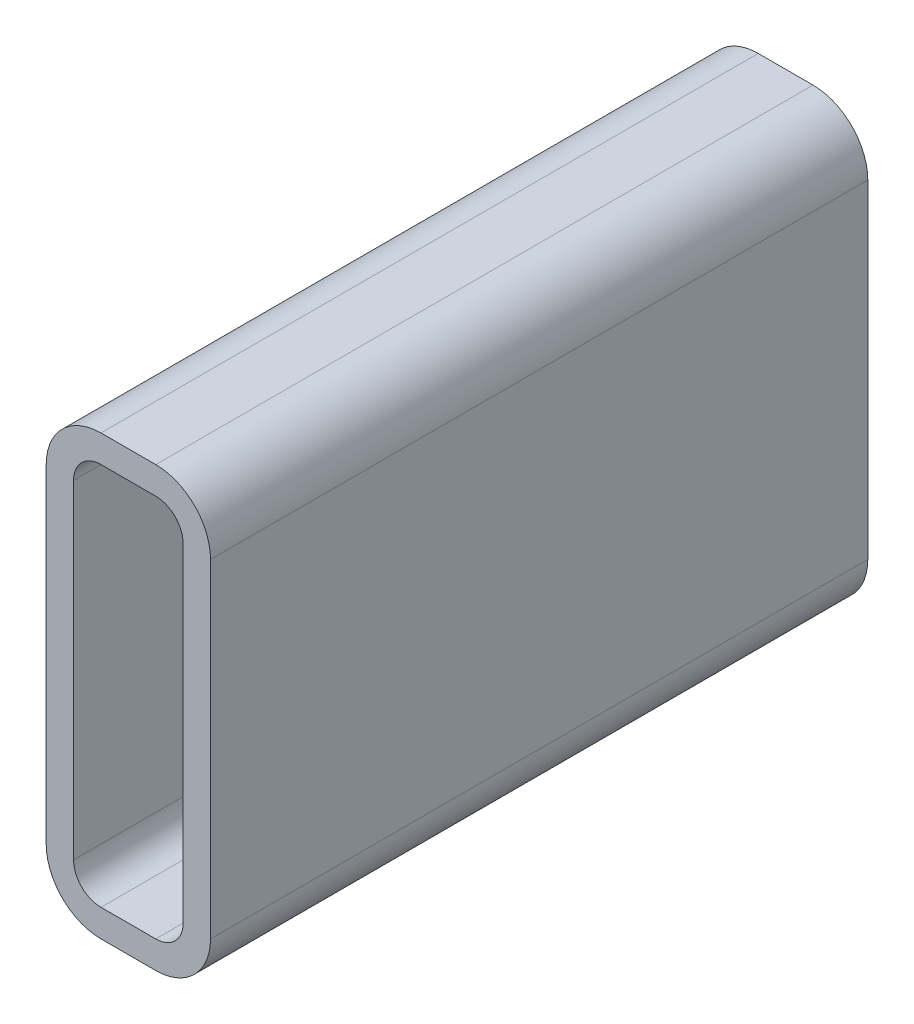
ISO-10303-21;
HEADER;
FILE_DESCRIPTION(('STEP AP214'),'2;1');
FILE_NAME('part.step','',(''),(''),'','','');
FILE_SCHEMA(('AUTOMOTIVE_DESIGN { 1 0 10303 214 1 1 1 1 }'));
ENDSEC;
DATA;
#1=APPLICATION_CONTEXT('core data for automotive mechanical design processes');
#2=APPLICATION_PROTOCOL_DEFINITION('international standard','automotive_design',2000,#1);
#3=PRODUCT_CONTEXT('',#1,'mechanical');
#4=PRODUCT('Part','Part','',(#3));
#5=PRODUCT_RELATED_PRODUCT_CATEGORY('part','',(#4));
#6=PRODUCT_DEFINITION_FORMATION('','',#4);
#7=PRODUCT_DEFINITION_CONTEXT('part definition',#1,'design');
#8=PRODUCT_DEFINITION('design','',#6,#7);
#9=PRODUCT_DEFINITION_SHAPE('','',#8);
#10=(LENGTH_UNIT() NAMED_UNIT(*) SI_UNIT(.MILLI.,.METRE.));
#11=(NAMED_UNIT(*) PLANE_ANGLE_UNIT() SI_UNIT($,.RADIAN.));
#12=(NAMED_UNIT(*) SI_UNIT($,.STERADIAN.) SOLID_ANGLE_UNIT());
#13=UNCERTAINTY_MEASURE_WITH_UNIT(LENGTH_MEASURE(1.E-05),#10,'distance_accuracy_value','');
#14=(GEOMETRIC_REPRESENTATION_CONTEXT(3) GLOBAL_UNCERTAINTY_ASSIGNED_CONTEXT((#13)) GLOBAL_UNIT_ASSIGNED_CONTEXT((#10,
#11,#12)) REPRESENTATION_CONTEXT('',''));
#15=CARTESIAN_POINT('',(0.,0.,0.));
#16=DIRECTION('',(0.,0.,1.));
#17=DIRECTION('',(1.,0.,0.));
#18=AXIS2_PLACEMENT_3D('',#15,#16,#17);
#19=CARTESIAN_POINT('',(27.8891160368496,179.766130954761,304.8));
#20=DIRECTION('',(0.,0.,1.));
#21=DIRECTION('',(1.,0.,0.));
#22=AXIS2_PLACEMENT_3D('',#19,#20,#21);
#23=PLANE('',#22);
#24=CARTESIAN_POINT('',(27.8891160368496,179.766130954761,304.8));
#25=DIRECTION('',(0.,0.,1.));
#26=DIRECTION('',(1.,0.,0.));
#27=AXIS2_PLACEMENT_3D('',#24,#25,#26);
#28=CIRCLE('',#27,25.4);
#29=CARTESIAN_POINT('',(27.8891160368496,205.166130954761,304.8));
#30=VERTEX_POINT('',#29);
#31=CARTESIAN_POINT('',(2.48911603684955,179.766130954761,304.8));
#32=VERTEX_POINT('',#31);
#33=EDGE_CURVE('E211',#30,#32,#28,.T.);
#34=ORIENTED_EDGE('',*,*,#33,.T.);
#35=DIRECTION('',(0.,-1.,0.));
#36=VECTOR('',#35,1.);
#37=CARTESIAN_POINT('',(2.48911603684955,27.3661309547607,304.8));
#38=LINE('',#37,#36);
#39=CARTESIAN_POINT('',(2.48911603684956,27.3661309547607,304.8));
#40=VERTEX_POINT('',#39);
#41=EDGE_CURVE('E214',#32,#40,#38,.T.);
#42=ORIENTED_EDGE('',*,*,#41,.T.);
#43=CARTESIAN_POINT('',(27.8891160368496,27.3661309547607,304.8));
#44=DIRECTION('',(0.,0.,1.));
#45=DIRECTION('',(1.,0.,0.));
#46=AXIS2_PLACEMENT_3D('',#43,#44,#45);
#47=CIRCLE('',#46,25.4);
#48=CARTESIAN_POINT('',(27.8891160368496,1.96613095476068,304.8));
#49=VERTEX_POINT('',#48);
#50=EDGE_CURVE('E217',#40,#49,#47,.T.);
#51=ORIENTED_EDGE('',*,*,#50,.T.);
#52=DIRECTION('',(1.,0.,0.));
#53=VECTOR('',#52,1.);
#54=CARTESIAN_POINT('',(53.2891160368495,1.96613095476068,304.8));
#55=LINE('',#54,#53);
#56=CARTESIAN_POINT('',(53.2891160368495,1.96613095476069,304.8));
#57=VERTEX_POINT('',#56);
#58=EDGE_CURVE('E219',#49,#57,#55,.T.);
#59=ORIENTED_EDGE('',*,*,#58,.T.);
#60=CARTESIAN_POINT('',(53.2891160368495,27.3661309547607,304.8));
#61=DIRECTION('',(0.,0.,1.));
#62=DIRECTION('',(1.,0.,0.));
#63=AXIS2_PLACEMENT_3D('',#60,#61,#62);
#64=CIRCLE('',#63,25.4);
#65=CARTESIAN_POINT('',(78.6891160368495,27.3661309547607,304.8));
#66=VERTEX_POINT('',#65);
#67=EDGE_CURVE('E221',#57,#66,#64,.T.);
#68=ORIENTED_EDGE('',*,*,#67,.T.);
#69=DIRECTION('',(0.,1.,0.));
#70=VECTOR('',#69,1.);
#71=CARTESIAN_POINT('',(78.6891160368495,179.766130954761,304.8));
#72=LINE('',#71,#70);
#73=CARTESIAN_POINT('',(78.6891160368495,179.766130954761,304.8));
#74=VERTEX_POINT('',#73);
#75=EDGE_CURVE('E223',#66,#74,#72,.T.);
#76=ORIENTED_EDGE('',*,*,#75,.T.);
#77=CARTESIAN_POINT('',(53.2891160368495,179.766130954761,304.8));
#78=DIRECTION('',(0.,0.,1.));
#79=DIRECTION('',(1.,0.,0.));
#80=AXIS2_PLACEMENT_3D('',#77,#78,#79);
#81=CIRCLE('',#80,25.4);
#82=CARTESIAN_POINT('',(53.2891160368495,205.166130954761,304.8));
#83=VERTEX_POINT('',#82);
#84=EDGE_CURVE('E225',#74,#83,#81,.T.);
#85=ORIENTED_EDGE('',*,*,#84,.T.);
#86=DIRECTION('',(-1.,0.,0.));
#87=VECTOR('',#86,1.);
#88=CARTESIAN_POINT('',(27.8891160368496,205.166130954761,304.8));
#89=LINE('',#88,#87);
#90=EDGE_CURVE('E227',#83,#30,#89,.T.);
#91=ORIENTED_EDGE('',*,*,#90,.T.);
#92=EDGE_LOOP('',(#34,#42,#51,#59,#68,#76,#85,#91));
#93=FACE_BOUND('',#92,.T.);
#94=DIRECTION('',(0.,-1.,0.));
#95=VECTOR('',#94,1.);
#96=CARTESIAN_POINT('',(15.1891160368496,27.3661309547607,304.8));
#97=LINE('',#96,#95);
#98=CARTESIAN_POINT('',(15.1891160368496,179.766130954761,304.8));
#99=VERTEX_POINT('',#98);
#100=CARTESIAN_POINT('',(15.1891160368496,27.3661309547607,304.8));
#101=VERTEX_POINT('',#100);
#102=EDGE_CURVE('E154',#99,#101,#97,.T.);
#103=ORIENTED_EDGE('',*,*,#102,.F.);
#104=CARTESIAN_POINT('',(27.8891160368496,179.766130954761,304.8));
#105=DIRECTION('',(0.,0.,1.));
#106=DIRECTION('',(1.,0.,0.));
#107=AXIS2_PLACEMENT_3D('',#104,#105,#106);
#108=CIRCLE('',#107,12.7);
#109=CARTESIAN_POINT('',(27.8891160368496,192.466130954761,304.8));
#110=VERTEX_POINT('',#109);
#111=EDGE_CURVE('E146',#110,#99,#108,.T.);
#112=ORIENTED_EDGE('',*,*,#111,.F.);
#113=DIRECTION('',(-1.,0.,0.));
#114=VECTOR('',#113,1.);
#115=CARTESIAN_POINT('',(27.8891160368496,192.466130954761,304.8));
#116=LINE('',#115,#114);
#117=CARTESIAN_POINT('',(53.2891160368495,192.466130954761,304.8));
#118=VERTEX_POINT('',#117);
#119=EDGE_CURVE('E179',#118,#110,#116,.T.);
#120=ORIENTED_EDGE('',*,*,#119,.F.);
#121=CARTESIAN_POINT('',(53.2891160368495,179.766130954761,304.8));
#122=DIRECTION('',(0.,0.,1.));
#123=DIRECTION('',(1.,0.,0.));
#124=AXIS2_PLACEMENT_3D('',#121,#122,#123);
#125=CIRCLE('',#124,12.7);
#126=CARTESIAN_POINT('',(65.9891160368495,179.766130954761,304.8));
#127=VERTEX_POINT('',#126);
#128=EDGE_CURVE('E177',#127,#118,#125,.T.);
#129=ORIENTED_EDGE('',*,*,#128,.F.);
#130=DIRECTION('',(0.,1.,0.));
#131=VECTOR('',#130,1.);
#132=CARTESIAN_POINT('',(65.9891160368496,179.766130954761,304.8));
#133=LINE('',#132,#131);
#134=CARTESIAN_POINT('',(65.9891160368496,27.3661309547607,304.8));
#135=VERTEX_POINT('',#134);
#136=EDGE_CURVE('E175',#135,#127,#133,.T.);
#137=ORIENTED_EDGE('',*,*,#136,.F.);
#138=CARTESIAN_POINT('',(53.2891160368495,27.3661309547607,304.8));
#139=DIRECTION('',(0.,0.,1.));
#140=DIRECTION('',(1.,0.,0.));
#141=AXIS2_PLACEMENT_3D('',#138,#139,#140);
#142=CIRCLE('',#141,12.7);
#143=CARTESIAN_POINT('',(53.2891160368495,14.6661309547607,304.8));
#144=VERTEX_POINT('',#143);
#145=EDGE_CURVE('E173',#144,#135,#142,.T.);
#146=ORIENTED_EDGE('',*,*,#145,.F.);
#147=DIRECTION('',(1.,0.,0.));
#148=VECTOR('',#147,1.);
#149=CARTESIAN_POINT('',(53.2891160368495,14.6661309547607,304.8));
#150=LINE('',#149,#148);
#151=CARTESIAN_POINT('',(27.8891160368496,14.6661309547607,304.8));
#152=VERTEX_POINT('',#151);
#153=EDGE_CURVE('E169',#152,#144,#150,.T.);
#154=ORIENTED_EDGE('',*,*,#153,.F.);
#155=CARTESIAN_POINT('',(27.8891160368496,27.3661309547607,304.8));
#156=DIRECTION('',(0.,0.,1.));
#157=DIRECTION('',(1.,0.,0.));
#158=AXIS2_PLACEMENT_3D('',#155,#156,#157);
#159=CIRCLE('',#158,12.7);
#160=EDGE_CURVE('E167',#101,#152,#159,.T.);
#161=ORIENTED_EDGE('',*,*,#160,.F.);
#162=EDGE_LOOP('',(#103,#112,#120,#129,#137,#146,#154,#161));
#163=FACE_BOUND('',#162,.T.);
#164=ADVANCED_FACE('F33',(#93,#163),#23,.T.);
#165=CARTESIAN_POINT('',(27.8891160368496,179.766130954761,0.));
#166=DIRECTION('',(0.,0.,1.));
#167=DIRECTION('',(1.,0.,0.));
#168=AXIS2_PLACEMENT_3D('',#165,#166,#167);
#169=PLANE('',#168);
#170=CARTESIAN_POINT('',(27.8891160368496,179.766130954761,0.));
#171=DIRECTION('',(0.,0.,1.));
#172=DIRECTION('',(1.,0.,0.));
#173=AXIS2_PLACEMENT_3D('',#170,#171,#172);
#174=CIRCLE('',#173,25.4);
#175=CARTESIAN_POINT('',(27.8891160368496,205.166130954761,0.));
#176=VERTEX_POINT('',#175);
#177=CARTESIAN_POINT('',(2.48911603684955,179.766130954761,0.));
#178=VERTEX_POINT('',#177);
#179=EDGE_CURVE('E162',#176,#178,#174,.T.);
#180=ORIENTED_EDGE('',*,*,#179,.F.);
#181=DIRECTION('',(-1.,0.,0.));
#182=VECTOR('',#181,1.);
#183=CARTESIAN_POINT('',(27.8891160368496,205.166130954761,0.));
#184=LINE('',#183,#182);
#185=CARTESIAN_POINT('',(53.2891160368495,205.166130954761,0.));
#186=VERTEX_POINT('',#185);
#187=EDGE_CURVE('E215',#186,#176,#184,.T.);
#188=ORIENTED_EDGE('',*,*,#187,.F.);
#189=CARTESIAN_POINT('',(53.2891160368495,179.766130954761,0.));
#190=DIRECTION('',(0.,0.,1.));
#191=DIRECTION('',(1.,0.,0.));
#192=AXIS2_PLACEMENT_3D('',#189,#190,#191);
#193=CIRCLE('',#192,25.4);
#194=CARTESIAN_POINT('',(78.6891160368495,179.766130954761,0.));
#195=VERTEX_POINT('',#194);
#196=EDGE_CURVE('E242',#195,#186,#193,.T.);
#197=ORIENTED_EDGE('',*,*,#196,.F.);
#198=DIRECTION('',(0.,1.,0.));
#199=VECTOR('',#198,1.);
#200=CARTESIAN_POINT('',(78.6891160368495,179.766130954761,0.));
#201=LINE('',#200,#199);
#202=CARTESIAN_POINT('',(78.6891160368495,27.3661309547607,0.));
#203=VERTEX_POINT('',#202);
#204=EDGE_CURVE('E240',#203,#195,#201,.T.);
#205=ORIENTED_EDGE('',*,*,#204,.F.);
#206=CARTESIAN_POINT('',(53.2891160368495,27.3661309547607,0.));
#207=DIRECTION('',(0.,0.,1.));
#208=DIRECTION('',(1.,0.,0.));
#209=AXIS2_PLACEMENT_3D('',#206,#207,#208);
#210=CIRCLE('',#209,25.4);
#211=CARTESIAN_POINT('',(53.2891160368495,1.96613095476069,0.));
#212=VERTEX_POINT('',#211);
#213=EDGE_CURVE('E238',#212,#203,#210,.T.);
#214=ORIENTED_EDGE('',*,*,#213,.F.);
#215=DIRECTION('',(1.,0.,0.));
#216=VECTOR('',#215,1.);
#217=CARTESIAN_POINT('',(53.2891160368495,1.96613095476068,0.));
#218=LINE('',#217,#216);
#219=CARTESIAN_POINT('',(27.8891160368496,1.96613095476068,0.));
#220=VERTEX_POINT('',#219);
#221=EDGE_CURVE('E236',#220,#212,#218,.T.);
#222=ORIENTED_EDGE('',*,*,#221,.F.);
#223=CARTESIAN_POINT('',(27.8891160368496,27.3661309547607,0.));
#224=DIRECTION('',(0.,0.,1.));
#225=DIRECTION('',(1.,0.,0.));
#226=AXIS2_PLACEMENT_3D('',#223,#224,#225);
#227=CIRCLE('',#226,25.4);
#228=CARTESIAN_POINT('',(2.48911603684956,27.3661309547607,0.));
#229=VERTEX_POINT('',#228);
#230=EDGE_CURVE('E234',#229,#220,#227,.T.);
#231=ORIENTED_EDGE('',*,*,#230,.F.);
#232=DIRECTION('',(0.,-1.,0.));
#233=VECTOR('',#232,1.);
#234=CARTESIAN_POINT('',(2.48911603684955,27.3661309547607,0.));
#235=LINE('',#234,#233);
#236=EDGE_CURVE('E232',#178,#229,#235,.T.);
#237=ORIENTED_EDGE('',*,*,#236,.F.);
#238=EDGE_LOOP('',(#180,#188,#197,#205,#214,#222,#231,#237));
#239=FACE_BOUND('',#238,.T.);
#240=CARTESIAN_POINT('',(27.8891160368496,179.766130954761,0.));
#241=DIRECTION('',(0.,0.,1.));
#242=DIRECTION('',(1.,0.,0.));
#243=AXIS2_PLACEMENT_3D('',#240,#241,#242);
#244=CIRCLE('',#243,12.7);
#245=CARTESIAN_POINT('',(27.8891160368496,192.466130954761,0.));
#246=VERTEX_POINT('',#245);
#247=CARTESIAN_POINT('',(15.1891160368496,179.766130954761,0.));
#248=VERTEX_POINT('',#247);
#249=EDGE_CURVE('E56',#246,#248,#244,.T.);
#250=ORIENTED_EDGE('',*,*,#249,.T.);
#251=DIRECTION('',(0.,-1.,0.));
#252=VECTOR('',#251,1.);
#253=CARTESIAN_POINT('',(15.1891160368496,27.3661309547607,0.));
#254=LINE('',#253,#252);
#255=CARTESIAN_POINT('',(15.1891160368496,27.3661309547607,0.));
#256=VERTEX_POINT('',#255);
#257=EDGE_CURVE('E161',#248,#256,#254,.T.);
#258=ORIENTED_EDGE('',*,*,#257,.T.);
#259=CARTESIAN_POINT('',(27.8891160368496,27.3661309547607,0.));
#260=DIRECTION('',(0.,0.,1.));
#261=DIRECTION('',(1.,0.,0.));
#262=AXIS2_PLACEMENT_3D('',#259,#260,#261);
#263=CIRCLE('',#262,12.7);
#264=CARTESIAN_POINT('',(27.8891160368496,14.6661309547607,0.));
#265=VERTEX_POINT('',#264);
#266=EDGE_CURVE('E183',#256,#265,#263,.T.);
#267=ORIENTED_EDGE('',*,*,#266,.T.);
#268=DIRECTION('',(1.,0.,0.));
#269=VECTOR('',#268,1.);
#270=CARTESIAN_POINT('',(53.2891160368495,14.6661309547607,0.));
#271=LINE('',#270,#269);
#272=CARTESIAN_POINT('',(53.2891160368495,14.6661309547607,0.));
#273=VERTEX_POINT('',#272);
#274=EDGE_CURVE('E186',#265,#273,#271,.T.);
#275=ORIENTED_EDGE('',*,*,#274,.T.);
#276=CARTESIAN_POINT('',(53.2891160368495,27.3661309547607,0.));
#277=DIRECTION('',(0.,0.,1.));
#278=DIRECTION('',(1.,0.,0.));
#279=AXIS2_PLACEMENT_3D('',#276,#277,#278);
#280=CIRCLE('',#279,12.7);
#281=CARTESIAN_POINT('',(65.9891160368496,27.3661309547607,0.));
#282=VERTEX_POINT('',#281);
#283=EDGE_CURVE('E189',#273,#282,#280,.T.);
#284=ORIENTED_EDGE('',*,*,#283,.T.);
#285=DIRECTION('',(0.,1.,0.));
#286=VECTOR('',#285,1.);
#287=CARTESIAN_POINT('',(65.9891160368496,179.766130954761,0.));
#288=LINE('',#287,#286);
#289=CARTESIAN_POINT('',(65.9891160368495,179.766130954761,0.));
#290=VERTEX_POINT('',#289);
#291=EDGE_CURVE('E192',#282,#290,#288,.T.);
#292=ORIENTED_EDGE('',*,*,#291,.T.);
#293=CARTESIAN_POINT('',(53.2891160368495,179.766130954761,0.));
#294=DIRECTION('',(0.,0.,1.));
#295=DIRECTION('',(1.,0.,0.));
#296=AXIS2_PLACEMENT_3D('',#293,#294,#295);
#297=CIRCLE('',#296,12.7);
#298=CARTESIAN_POINT('',(53.2891160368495,192.466130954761,0.));
#299=VERTEX_POINT('',#298);
#300=EDGE_CURVE('E195',#290,#299,#297,.T.);
#301=ORIENTED_EDGE('',*,*,#300,.T.);
#302=DIRECTION('',(-1.,0.,0.));
#303=VECTOR('',#302,1.);
#304=CARTESIAN_POINT('',(27.8891160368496,192.466130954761,0.));
#305=LINE('',#304,#303);
#306=EDGE_CURVE('E155',#299,#246,#305,.T.);
#307=ORIENTED_EDGE('',*,*,#306,.T.);
#308=EDGE_LOOP('',(#250,#258,#267,#275,#284,#292,#301,#307));
#309=FACE_BOUND('',#308,.T.);
#310=ADVANCED_FACE('F272',(#239,#309),#169,.F.);
#311=CARTESIAN_POINT('',(27.8891160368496,179.766130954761,304.8));
#312=DIRECTION('',(0.,0.,-1.));
#313=DIRECTION('',(-1.,0.,0.));
#314=AXIS2_PLACEMENT_3D('',#311,#312,#313);
#315=CYLINDRICAL_SURFACE('',#314,25.4);
#316=ORIENTED_EDGE('',*,*,#179,.T.);
#317=DIRECTION('',(0.,0.,-1.));
#318=VECTOR('',#317,1.);
#319=CARTESIAN_POINT('',(2.48911603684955,179.766130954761,304.8));
#320=LINE('',#319,#318);
#321=EDGE_CURVE('E11',#32,#178,#320,.T.);
#322=ORIENTED_EDGE('',*,*,#321,.F.);
#323=ORIENTED_EDGE('',*,*,#33,.F.);
#324=DIRECTION('',(0.,0.,-1.));
#325=VECTOR('',#324,1.);
#326=CARTESIAN_POINT('',(27.8891160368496,205.166130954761,304.8));
#327=LINE('',#326,#325);
#328=EDGE_CURVE('E229',#30,#176,#327,.T.);
#329=ORIENTED_EDGE('',*,*,#328,.T.);
#330=EDGE_LOOP('',(#316,#322,#323,#329));
#331=FACE_BOUND('',#330,.T.);
#332=ADVANCED_FACE('F35',(#331),#315,.T.);
#333=CARTESIAN_POINT('',(2.48911603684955,27.3661309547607,304.8));
#334=DIRECTION('',(1.,0.,0.));
#335=DIRECTION('',(0.,0.,-1.));
#336=AXIS2_PLACEMENT_3D('',#333,#334,#335);
#337=PLANE('',#336);
#338=ORIENTED_EDGE('',*,*,#236,.T.);
#339=DIRECTION('',(0.,0.,-1.));
#340=VECTOR('',#339,1.);
#341=CARTESIAN_POINT('',(2.48911603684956,27.3661309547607,304.8));
#342=LINE('',#341,#340);
#343=EDGE_CURVE('E41',#40,#229,#342,.T.);
#344=ORIENTED_EDGE('',*,*,#343,.F.);
#345=ORIENTED_EDGE('',*,*,#41,.F.);
#346=ORIENTED_EDGE('',*,*,#321,.T.);
#347=EDGE_LOOP('',(#338,#344,#345,#346));
#348=FACE_BOUND('',#347,.T.);
#349=ADVANCED_FACE('F289',(#348),#337,.F.);
#350=CARTESIAN_POINT('',(27.8891160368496,27.3661309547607,304.8));
#351=DIRECTION('',(0.,0.,-1.));
#352=DIRECTION('',(-1.,0.,0.));
#353=AXIS2_PLACEMENT_3D('',#350,#351,#352);
#354=CYLINDRICAL_SURFACE('',#353,25.4);
#355=ORIENTED_EDGE('',*,*,#230,.T.);
#356=DIRECTION('',(0.,0.,-1.));
#357=VECTOR('',#356,1.);
#358=CARTESIAN_POINT('',(27.8891160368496,1.96613095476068,304.8));
#359=LINE('',#358,#357);
#360=EDGE_CURVE('E259',#49,#220,#359,.T.);
#361=ORIENTED_EDGE('',*,*,#360,.F.);
#362=ORIENTED_EDGE('',*,*,#50,.F.);
#363=ORIENTED_EDGE('',*,*,#343,.T.);
#364=EDGE_LOOP('',(#355,#361,#362,#363));
#365=FACE_BOUND('',#364,.T.);
#366=ADVANCED_FACE('F266',(#365),#354,.T.);
#367=CARTESIAN_POINT('',(53.2891160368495,1.96613095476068,304.8));
#368=DIRECTION('',(0.,1.,0.));
#369=DIRECTION('',(0.,0.,1.));
#370=AXIS2_PLACEMENT_3D('',#367,#368,#369);
#371=PLANE('',#370);
#372=ORIENTED_EDGE('',*,*,#221,.T.);
#373=DIRECTION('',(0.,0.,-1.));
#374=VECTOR('',#373,1.);
#375=CARTESIAN_POINT('',(53.2891160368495,1.96613095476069,304.8));
#376=LINE('',#375,#374);
#377=EDGE_CURVE('E256',#57,#212,#376,.T.);
#378=ORIENTED_EDGE('',*,*,#377,.F.);
#379=ORIENTED_EDGE('',*,*,#58,.F.);
#380=ORIENTED_EDGE('',*,*,#360,.T.);
#381=EDGE_LOOP('',(#372,#378,#379,#380));
#382=FACE_BOUND('',#381,.T.);
#383=ADVANCED_FACE('F278',(#382),#371,.F.);
#384=CARTESIAN_POINT('',(53.2891160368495,27.3661309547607,304.8));
#385=DIRECTION('',(0.,0.,-1.));
#386=DIRECTION('',(-1.,0.,0.));
#387=AXIS2_PLACEMENT_3D('',#384,#385,#386);
#388=CYLINDRICAL_SURFACE('',#387,25.4);
#389=ORIENTED_EDGE('',*,*,#213,.T.);
#390=DIRECTION('',(0.,0.,-1.));
#391=VECTOR('',#390,1.);
#392=CARTESIAN_POINT('',(78.6891160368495,27.3661309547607,304.8));
#393=LINE('',#392,#391);
#394=EDGE_CURVE('E253',#66,#203,#393,.T.);
#395=ORIENTED_EDGE('',*,*,#394,.F.);
#396=ORIENTED_EDGE('',*,*,#67,.F.);
#397=ORIENTED_EDGE('',*,*,#377,.T.);
#398=EDGE_LOOP('',(#389,#395,#396,#397));
#399=FACE_BOUND('',#398,.T.);
#400=ADVANCED_FACE('F282',(#399),#388,.T.);
#401=CARTESIAN_POINT('',(78.6891160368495,179.766130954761,304.8));
#402=DIRECTION('',(-1.,0.,0.));
#403=DIRECTION('',(0.,0.,1.));
#404=AXIS2_PLACEMENT_3D('',#401,#402,#403);
#405=PLANE('',#404);
#406=ORIENTED_EDGE('',*,*,#204,.T.);
#407=DIRECTION('',(0.,0.,-1.));
#408=VECTOR('',#407,1.);
#409=CARTESIAN_POINT('',(78.6891160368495,179.766130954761,304.8));
#410=LINE('',#409,#408);
#411=EDGE_CURVE('E250',#74,#195,#410,.T.);
#412=ORIENTED_EDGE('',*,*,#411,.F.);
#413=ORIENTED_EDGE('',*,*,#75,.F.);
#414=ORIENTED_EDGE('',*,*,#394,.T.);
#415=EDGE_LOOP('',(#406,#412,#413,#414));
#416=FACE_BOUND('',#415,.T.);
#417=ADVANCED_FACE('F302',(#416),#405,.F.);
#418=CARTESIAN_POINT('',(53.2891160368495,179.766130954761,304.8));
#419=DIRECTION('',(0.,0.,-1.));
#420=DIRECTION('',(-1.,0.,0.));
#421=AXIS2_PLACEMENT_3D('',#418,#419,#420);
#422=CYLINDRICAL_SURFACE('',#421,25.4);
#423=ORIENTED_EDGE('',*,*,#196,.T.);
#424=DIRECTION('',(0.,0.,-1.));
#425=VECTOR('',#424,1.);
#426=CARTESIAN_POINT('',(53.2891160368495,205.166130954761,304.8));
#427=LINE('',#426,#425);
#428=EDGE_CURVE('E247',#83,#186,#427,.T.);
#429=ORIENTED_EDGE('',*,*,#428,.F.);
#430=ORIENTED_EDGE('',*,*,#84,.F.);
#431=ORIENTED_EDGE('',*,*,#411,.T.);
#432=EDGE_LOOP('',(#423,#429,#430,#431));
#433=FACE_BOUND('',#432,.T.);
#434=ADVANCED_FACE('F300',(#433),#422,.T.);
#435=CARTESIAN_POINT('',(27.8891160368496,205.166130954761,304.8));
#436=DIRECTION('',(0.,-1.,0.));
#437=DIRECTION('',(0.,0.,-1.));
#438=AXIS2_PLACEMENT_3D('',#435,#436,#437);
#439=PLANE('',#438);
#440=ORIENTED_EDGE('',*,*,#187,.T.);
#441=ORIENTED_EDGE('',*,*,#328,.F.);
#442=ORIENTED_EDGE('',*,*,#90,.F.);
#443=ORIENTED_EDGE('',*,*,#428,.T.);
#444=EDGE_LOOP('',(#440,#441,#442,#443));
#445=FACE_BOUND('',#444,.T.);
#446=ADVANCED_FACE('F295',(#445),#439,.F.);
#447=CARTESIAN_POINT('',(27.8891160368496,179.766130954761,304.8));
#448=DIRECTION('',(0.,0.,-1.));
#449=DIRECTION('',(-1.,0.,0.));
#450=AXIS2_PLACEMENT_3D('',#447,#448,#449);
#451=CYLINDRICAL_SURFACE('',#450,12.7);
#452=ORIENTED_EDGE('',*,*,#249,.F.);
#453=DIRECTION('',(0.,0.,-1.));
#454=VECTOR('',#453,1.);
#455=CARTESIAN_POINT('',(27.8891160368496,192.466130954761,304.8));
#456=LINE('',#455,#454);
#457=EDGE_CURVE('E150',#110,#246,#456,.T.);
#458=ORIENTED_EDGE('',*,*,#457,.F.);
#459=ORIENTED_EDGE('',*,*,#111,.T.);
#460=DIRECTION('',(0.,0.,-1.));
#461=VECTOR('',#460,1.);
#462=CARTESIAN_POINT('',(15.1891160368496,179.766130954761,304.8));
#463=LINE('',#462,#461);
#464=EDGE_CURVE('E149',#99,#248,#463,.T.);
#465=ORIENTED_EDGE('',*,*,#464,.T.);
#466=EDGE_LOOP('',(#452,#458,#459,#465));
#467=FACE_BOUND('',#466,.T.);
#468=ADVANCED_FACE('F148',(#467),#451,.F.);
#469=CARTESIAN_POINT('',(15.1891160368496,27.3661309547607,304.8));
#470=DIRECTION('',(1.,0.,0.));
#471=DIRECTION('',(0.,0.,-1.));
#472=AXIS2_PLACEMENT_3D('',#469,#470,#471);
#473=PLANE('',#472);
#474=ORIENTED_EDGE('',*,*,#257,.F.);
#475=ORIENTED_EDGE('',*,*,#464,.F.);
#476=ORIENTED_EDGE('',*,*,#102,.T.);
#477=DIRECTION('',(0.,0.,-1.));
#478=VECTOR('',#477,1.);
#479=CARTESIAN_POINT('',(15.1891160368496,27.3661309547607,304.8));
#480=LINE('',#479,#478);
#481=EDGE_CURVE('E163',#101,#256,#480,.T.);
#482=ORIENTED_EDGE('',*,*,#481,.T.);
#483=EDGE_LOOP('',(#474,#475,#476,#482));
#484=FACE_BOUND('',#483,.T.);
#485=ADVANCED_FACE('F158',(#484),#473,.T.);
#486=CARTESIAN_POINT('',(27.8891160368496,27.3661309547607,304.8));
#487=DIRECTION('',(0.,0.,-1.));
#488=DIRECTION('',(-1.,0.,0.));
#489=AXIS2_PLACEMENT_3D('',#486,#487,#488);
#490=CYLINDRICAL_SURFACE('',#489,12.7);
#491=ORIENTED_EDGE('',*,*,#266,.F.);
#492=ORIENTED_EDGE('',*,*,#481,.F.);
#493=ORIENTED_EDGE('',*,*,#160,.T.);
#494=DIRECTION('',(0.,0.,-1.));
#495=VECTOR('',#494,1.);
#496=CARTESIAN_POINT('',(27.8891160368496,14.6661309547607,304.8));
#497=LINE('',#496,#495);
#498=EDGE_CURVE('E208',#152,#265,#497,.T.);
#499=ORIENTED_EDGE('',*,*,#498,.T.);
#500=EDGE_LOOP('',(#491,#492,#493,#499));
#501=FACE_BOUND('',#500,.T.);
#502=ADVANCED_FACE('F327',(#501),#490,.F.);
#503=CARTESIAN_POINT('',(53.2891160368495,14.6661309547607,304.8));
#504=DIRECTION('',(0.,1.,0.));
#505=DIRECTION('',(0.,0.,1.));
#506=AXIS2_PLACEMENT_3D('',#503,#504,#505);
#507=PLANE('',#506);
#508=ORIENTED_EDGE('',*,*,#274,.F.);
#509=ORIENTED_EDGE('',*,*,#498,.F.);
#510=ORIENTED_EDGE('',*,*,#153,.T.);
#511=DIRECTION('',(0.,0.,-1.));
#512=VECTOR('',#511,1.);
#513=CARTESIAN_POINT('',(53.2891160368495,14.6661309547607,304.8));
#514=LINE('',#513,#512);
#515=EDGE_CURVE('E206',#144,#273,#514,.T.);
#516=ORIENTED_EDGE('',*,*,#515,.T.);
#517=EDGE_LOOP('',(#508,#509,#510,#516));
#518=FACE_BOUND('',#517,.T.);
#519=ADVANCED_FACE('F331',(#518),#507,.T.);
#520=CARTESIAN_POINT('',(53.2891160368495,27.3661309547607,304.8));
#521=DIRECTION('',(0.,0.,-1.));
#522=DIRECTION('',(-1.,0.,0.));
#523=AXIS2_PLACEMENT_3D('',#520,#521,#522);
#524=CYLINDRICAL_SURFACE('',#523,12.7);
#525=ORIENTED_EDGE('',*,*,#283,.F.);
#526=ORIENTED_EDGE('',*,*,#515,.F.);
#527=ORIENTED_EDGE('',*,*,#145,.T.);
#528=DIRECTION('',(0.,0.,-1.));
#529=VECTOR('',#528,1.);
#530=CARTESIAN_POINT('',(65.9891160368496,27.3661309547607,304.8));
#531=LINE('',#530,#529);
#532=EDGE_CURVE('E204',#135,#282,#531,.T.);
#533=ORIENTED_EDGE('',*,*,#532,.T.);
#534=EDGE_LOOP('',(#525,#526,#527,#533));
#535=FACE_BOUND('',#534,.T.);
#536=ADVANCED_FACE('F337',(#535),#524,.F.);
#537=CARTESIAN_POINT('',(65.9891160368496,179.766130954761,304.8));
#538=DIRECTION('',(-1.,0.,0.));
#539=DIRECTION('',(0.,0.,1.));
#540=AXIS2_PLACEMENT_3D('',#537,#538,#539);
#541=PLANE('',#540);
#542=ORIENTED_EDGE('',*,*,#291,.F.);
#543=ORIENTED_EDGE('',*,*,#532,.F.);
#544=ORIENTED_EDGE('',*,*,#136,.T.);
#545=DIRECTION('',(0.,0.,-1.));
#546=VECTOR('',#545,1.);
#547=CARTESIAN_POINT('',(65.9891160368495,179.766130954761,304.8));
#548=LINE('',#547,#546);
#549=EDGE_CURVE('E202',#127,#290,#548,.T.);
#550=ORIENTED_EDGE('',*,*,#549,.T.);
#551=EDGE_LOOP('',(#542,#543,#544,#550));
#552=FACE_BOUND('',#551,.T.);
#553=ADVANCED_FACE('F341',(#552),#541,.T.);
#554=CARTESIAN_POINT('',(53.2891160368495,179.766130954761,304.8));
#555=DIRECTION('',(0.,0.,-1.));
#556=DIRECTION('',(-1.,0.,0.));
#557=AXIS2_PLACEMENT_3D('',#554,#555,#556);
#558=CYLINDRICAL_SURFACE('',#557,12.7);
#559=ORIENTED_EDGE('',*,*,#300,.F.);
#560=ORIENTED_EDGE('',*,*,#549,.F.);
#561=ORIENTED_EDGE('',*,*,#128,.T.);
#562=DIRECTION('',(0.,0.,-1.));
#563=VECTOR('',#562,1.);
#564=CARTESIAN_POINT('',(53.2891160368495,192.466130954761,304.8));
#565=LINE('',#564,#563);
#566=EDGE_CURVE('E48',#118,#299,#565,.T.);
#567=ORIENTED_EDGE('',*,*,#566,.T.);
#568=EDGE_LOOP('',(#559,#560,#561,#567));
#569=FACE_BOUND('',#568,.T.);
#570=ADVANCED_FACE('F345',(#569),#558,.F.);
#571=CARTESIAN_POINT('',(27.8891160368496,192.466130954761,304.8));
#572=DIRECTION('',(0.,-1.,0.));
#573=DIRECTION('',(0.,0.,-1.));
#574=AXIS2_PLACEMENT_3D('',#571,#572,#573);
#575=PLANE('',#574);
#576=ORIENTED_EDGE('',*,*,#306,.F.);
#577=ORIENTED_EDGE('',*,*,#566,.F.);
#578=ORIENTED_EDGE('',*,*,#119,.T.);
#579=ORIENTED_EDGE('',*,*,#457,.T.);
#580=EDGE_LOOP('',(#576,#577,#578,#579));
#581=FACE_BOUND('',#580,.T.);
#582=ADVANCED_FACE('F349',(#581),#575,.T.);
#583=CLOSED_SHELL('',(#164,#310,#332,#349,#366,#383,#400,#417,#434,#446,#468,#485,#502,#519,
#536,#553,#570,#582));
#584=MANIFOLD_SOLID_BREP('B2',#583);
#585=ADVANCED_BREP_SHAPE_REPRESENTATION('',(#18,#584),#14);
#586=SHAPE_DEFINITION_REPRESENTATION(#9,#585);
ENDSEC;
END-ISO-10303-21;
